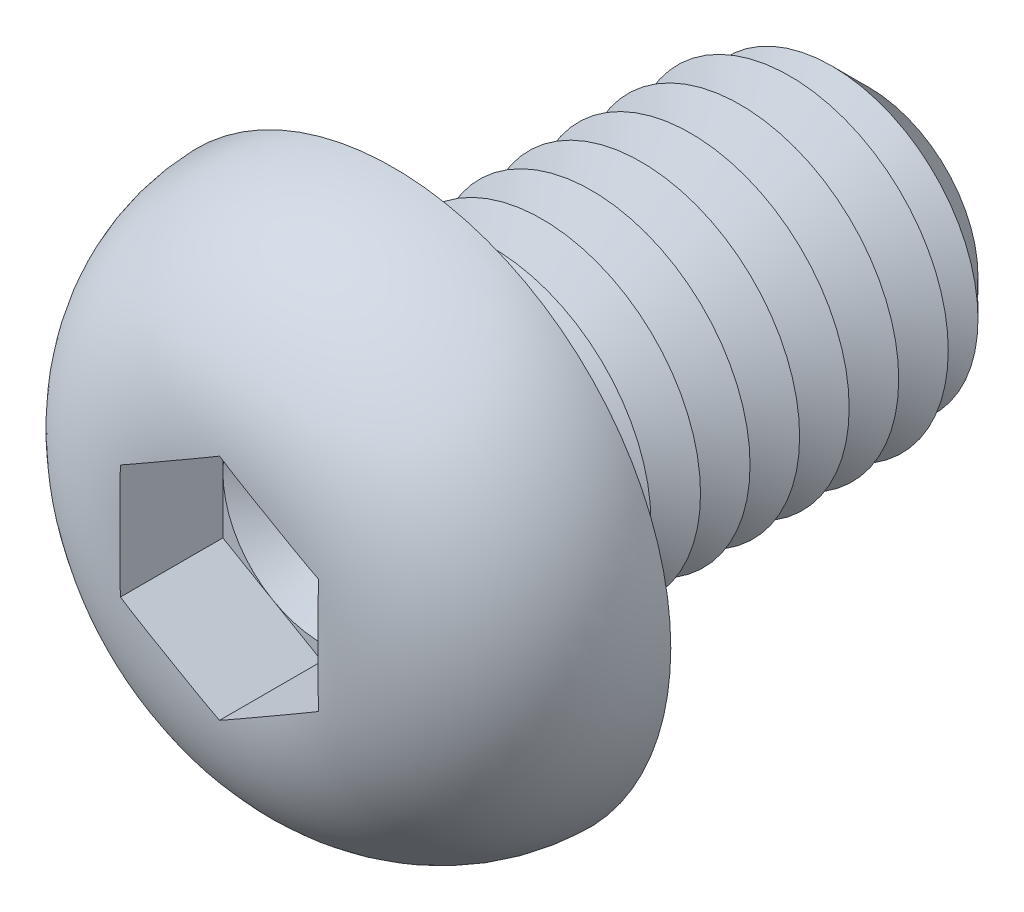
from build123d import *

# Parameters (mm, degrees)
CUT_EXTRUDE1_DEPTH  = 2.6
SKETCH4_R           = 4
BOSS_EXTRUDE1_DEPTH = 12
CHAMFER1_SIZE       = 1.25
LPATTERN1_COUNT     = 9
LPATTERN1_PITCH     = 1.25
FILLET2_R           = 0.5


with BuildPart() as part:
    # Sketch2 → Revolve1 (revolve)
    with BuildSketch(Plane(origin=(0, 0, 0), x_dir=(0, 0, -1), z_dir=(1, 0, 0)), mode=Mode.PRIVATE) as revolve1_sk:
        with BuildLine():
            Line((0, 0), (-4.4, 0))
            Line((-4.4, 0), (-4.4, 2.501111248))
            ThreePointArc((-4.4, 2.501111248), (-3.117141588, 5.647537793), (0, 7))
            Line((0, 7), (0, 0))
        make_face()
    revolve(revolve1_sk.sketch.rotate(Axis((0, 0, 47.934239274), (0, 0, -1)), 90), axis=Axis((0, 0, 47.934239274), (0, 0, -1)))

    # Sketch3 → Cut-Extrude1 (cut)
    with BuildSketch(Plane.XY.offset(4.4)):
        Polygon((0, 2.886751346), (-2.5, 1.443375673), (-2.5, -1.443375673), (0, -2.886751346), (2.5, -1.443375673), (2.5, 1.443375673), align=None)
    extrude(amount=-CUT_EXTRUDE1_DEPTH, mode=Mode.SUBTRACT)

    # Sketch4 → Boss-Extrude1 (add)
    with BuildSketch(Plane(origin=(0, 0, 0), x_dir=(-1, 0, 0), z_dir=(0, 0, -1))):
        with Locations(Location((0, 0, 0), (0, 0, 180))):
            Circle(SKETCH4_R)
    extrude(amount=BOSS_EXTRUDE1_DEPTH)

    # Chamfer1
    chamfer1_edges = [part.edges().sort_by_distance(p)[0] for p in [
        (-4, 0, -12),
    ]]
    chamfer(chamfer1_edges, length=CHAMFER1_SIZE)

    # Sketch5 → Cut-Revolve1 (revolve, cut)
    with BuildSketch(Plane(origin=(0, 0, 0), x_dir=(0, 0, -1), z_dir=(1, 0, 0)), mode=Mode.PRIVATE) as cut_revolve1_sk:
        Polygon((1.25, 4), (2.5, 4), (1.875, 2.917468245), align=None)
    cut_revolve1 = revolve(cut_revolve1_sk.sketch.rotate(Axis((0, 0, 47.934239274), (0, 0, -1)), 90), axis=Axis((0, 0, 47.934239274), (0, 0, -1)), mode=Mode.SUBTRACT)

    # LPattern1: Cut-Revolve1 ×9
    with Locations(*[(0, 0, -i * LPATTERN1_PITCH) for i in range(1, LPATTERN1_COUNT)]):
        add(cut_revolve1, mode=Mode.SUBTRACT)

    # Fillet2
    fillet2_edges = [part.edges().sort_by_distance(p)[0] for p in [
        (-4, 0, 0),
    ]]
    fillet(fillet2_edges, radius=FILLET2_R)

    # Cut-Extrude2 cone 1 section (on through the dimple's axis) → Cut-Extrude2 (revolve, cut)
    with BuildSketch(Plane(origin=(0, 0, 1.8), x_dir=(0, -1, 0), z_dir=(1, 0, 0))):
        Polygon((0, 0), (2.5, 0), (0, 1.443375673), align=None)
    revolve(axis=Axis((0, 0, 1.8), (0, 0, -1)), mode=Mode.SUBTRACT)


solid = part.part
